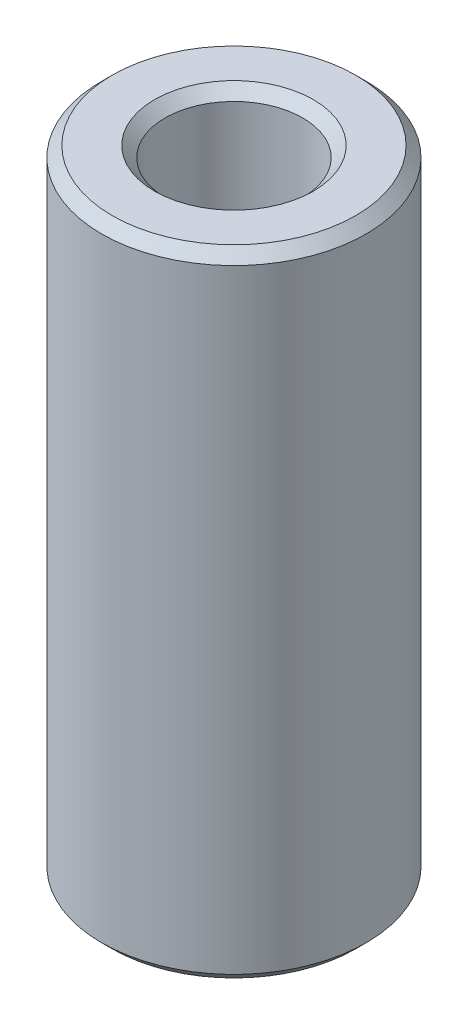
from build123d import *

# Parameters (mm, degrees)
SKIZZE1_R                       = 2.5
SKIZZE1_R_2                     = 1.3
AUFSATZ_LINEAR_AUSTRAGEN1_DEPTH = 12
FASE1_SIZE                      = 0.2


with BuildPart() as part:
    # Skizze1 → Aufsatz-Linear austragen1 (new body)
    with BuildSketch(Plane(origin=(0, 0, 0), x_dir=(1, 0, 0), z_dir=(0, 1, 0))):
        with Locations(Location((0, 0, 0), (0, 0, 270))):
            Circle(SKIZZE1_R)
        with Locations(Location((0, 0, 0), (0, 0, 270))):
            Circle(SKIZZE1_R_2, mode=Mode.SUBTRACT)
    extrude(amount=AUFSATZ_LINEAR_AUSTRAGEN1_DEPTH)

    # Fase1
    fase1_edges = [part.edges().sort_by_distance(p)[0] for p in [
        (0, 0, -2.5),
        (0, 12, -2.5),
        (0, 0, -1.3),
        (0, 12, -1.3),
    ]]
    chamfer(fase1_edges, length=FASE1_SIZE)


solid = part.part
